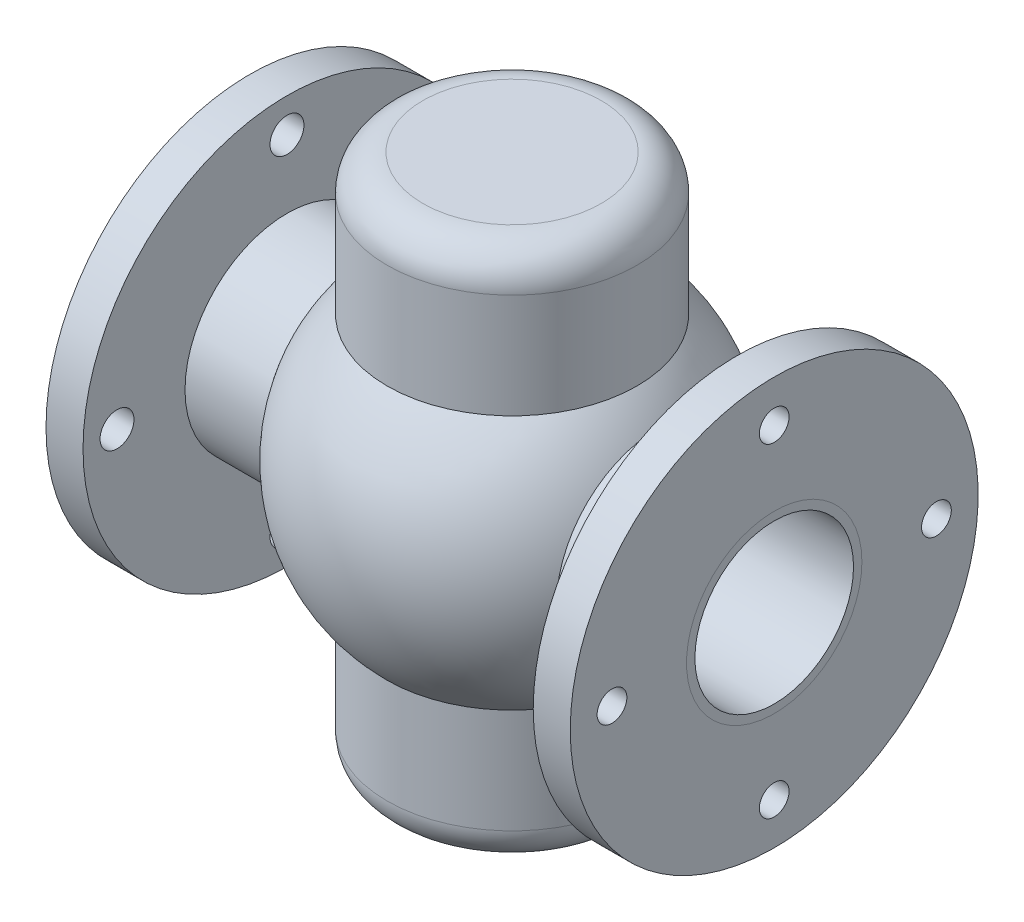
ISO-10303-21;
HEADER;
FILE_DESCRIPTION(('STEP AP214'),'2;1');
FILE_NAME('part.step','',(''),(''),'','','');
FILE_SCHEMA(('AUTOMOTIVE_DESIGN { 1 0 10303 214 1 1 1 1 }'));
ENDSEC;
DATA;
#1=APPLICATION_CONTEXT('core data for automotive mechanical design processes');
#2=APPLICATION_PROTOCOL_DEFINITION('international standard','automotive_design',2000,#1);
#3=PRODUCT_CONTEXT('',#1,'mechanical');
#4=PRODUCT('Part','Part','',(#3));
#5=PRODUCT_RELATED_PRODUCT_CATEGORY('part','',(#4));
#6=PRODUCT_DEFINITION_FORMATION('','',#4);
#7=PRODUCT_DEFINITION_CONTEXT('part definition',#1,'design');
#8=PRODUCT_DEFINITION('design','',#6,#7);
#9=PRODUCT_DEFINITION_SHAPE('','',#8);
#10=(LENGTH_UNIT() NAMED_UNIT(*) SI_UNIT(.MILLI.,.METRE.));
#11=(NAMED_UNIT(*) PLANE_ANGLE_UNIT() SI_UNIT($,.RADIAN.));
#12=(NAMED_UNIT(*) SI_UNIT($,.STERADIAN.) SOLID_ANGLE_UNIT());
#13=UNCERTAINTY_MEASURE_WITH_UNIT(LENGTH_MEASURE(1.E-05),#10,'distance_accuracy_value','');
#14=(GEOMETRIC_REPRESENTATION_CONTEXT(3) GLOBAL_UNCERTAINTY_ASSIGNED_CONTEXT((#13)) GLOBAL_UNIT_ASSIGNED_CONTEXT((#10,
#11,#12)) REPRESENTATION_CONTEXT('',''));
#15=CARTESIAN_POINT('',(0.,0.,0.));
#16=DIRECTION('',(0.,0.,1.));
#17=DIRECTION('',(1.,0.,0.));
#18=AXIS2_PLACEMENT_3D('',#15,#16,#17);
#19=CARTESIAN_POINT('',(146.9,114.3,0.));
#20=DIRECTION('',(1.,0.,0.));
#21=DIRECTION('',(0.,0.,-1.));
#22=AXIS2_PLACEMENT_3D('',#19,#20,#21);
#23=PLANE('',#22);
#24=CARTESIAN_POINT('',(146.9,90.8527596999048,0.));
#25=DIRECTION('',(-1.,0.,0.));
#26=DIRECTION('',(0.,0.,1.));
#27=AXIS2_PLACEMENT_3D('',#24,#25,#26);
#28=CIRCLE('',#27,8.3337399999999);
#29=CARTESIAN_POINT('',(146.9,90.8527596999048,8.3337399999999));
#30=VERTEX_POINT('',#29);
#31=EDGE_CURVE('E146',#30,#30,#28,.T.);
#32=ORIENTED_EDGE('',*,*,#31,.T.);
#33=EDGE_LOOP('',(#32));
#34=FACE_BOUND('',#33,.T.);
#35=CARTESIAN_POINT('',(146.9,0.,90.9113801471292));
#36=DIRECTION('',(-1.,0.,0.));
#37=DIRECTION('',(0.,0.,1.));
#38=AXIS2_PLACEMENT_3D('',#35,#36,#37);
#39=CIRCLE('',#38,8.3337399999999);
#40=CARTESIAN_POINT('',(146.9,0.,99.2451201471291));
#41=VERTEX_POINT('',#40);
#42=EDGE_CURVE('E140',#41,#41,#39,.T.);
#43=ORIENTED_EDGE('',*,*,#42,.T.);
#44=EDGE_LOOP('',(#43));
#45=FACE_BOUND('',#44,.T.);
#46=CARTESIAN_POINT('',(146.9,-90.9113801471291,0.));
#47=DIRECTION('',(-1.,0.,0.));
#48=DIRECTION('',(0.,0.,1.));
#49=AXIS2_PLACEMENT_3D('',#46,#47,#48);
#50=CIRCLE('',#49,8.3337399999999);
#51=CARTESIAN_POINT('',(146.9,-90.9113801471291,8.3337399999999));
#52=VERTEX_POINT('',#51);
#53=EDGE_CURVE('E134',#52,#52,#50,.T.);
#54=ORIENTED_EDGE('',*,*,#53,.T.);
#55=EDGE_LOOP('',(#54));
#56=FACE_BOUND('',#55,.T.);
#57=CARTESIAN_POINT('',(146.9,0.,-90.9113801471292));
#58=DIRECTION('',(-1.,0.,0.));
#59=DIRECTION('',(0.,0.,1.));
#60=AXIS2_PLACEMENT_3D('',#57,#58,#59);
#61=CIRCLE('',#60,8.3337399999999);
#62=CARTESIAN_POINT('',(146.9,0.,-82.5776401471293));
#63=VERTEX_POINT('',#62);
#64=EDGE_CURVE('E128',#63,#63,#61,.T.);
#65=ORIENTED_EDGE('',*,*,#64,.T.);
#66=EDGE_LOOP('',(#65));
#67=FACE_BOUND('',#66,.T.);
#68=CARTESIAN_POINT('',(146.9,0.,0.));
#69=DIRECTION('',(-1.,0.,0.));
#70=DIRECTION('',(0.,0.,1.));
#71=AXIS2_PLACEMENT_3D('',#68,#69,#70);
#72=CIRCLE('',#71,114.3);
#73=CARTESIAN_POINT('',(146.9,0.,114.3));
#74=VERTEX_POINT('',#73);
#75=EDGE_CURVE('E77',#74,#74,#72,.T.);
#76=ORIENTED_EDGE('',*,*,#75,.F.);
#77=EDGE_LOOP('',(#76));
#78=FACE_BOUND('',#77,.T.);
#79=CARTESIAN_POINT('',(146.9,0.,0.));
#80=DIRECTION('',(1.,0.,0.));
#81=DIRECTION('',(0.,0.,-1.));
#82=AXIS2_PLACEMENT_3D('',#79,#80,#81);
#83=CIRCLE('',#82,49.1499994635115);
#84=CARTESIAN_POINT('',(146.9,0.,-49.1499994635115));
#85=VERTEX_POINT('',#84);
#86=EDGE_CURVE('E10',#85,#85,#83,.F.);
#87=ORIENTED_EDGE('',*,*,#86,.T.);
#88=EDGE_LOOP('',(#87));
#89=FACE_BOUND('',#88,.T.);
#90=ADVANCED_FACE('F36',(#34,#45,#56,#67,#78,#89),#23,.T.);
#91=CARTESIAN_POINT('',(150.,0.,0.));
#92=DIRECTION('',(-1.,0.,0.));
#93=DIRECTION('',(0.,0.,1.));
#94=AXIS2_PLACEMENT_3D('',#91,#92,#93);
#95=CYLINDRICAL_SURFACE('',#94,44.45);
#96=CARTESIAN_POINT('',(-150.,0.,0.));
#97=DIRECTION('',(-1.,0.,0.));
#98=DIRECTION('',(0.,0.,1.));
#99=AXIS2_PLACEMENT_3D('',#96,#97,#98);
#100=CIRCLE('',#99,44.45);
#101=CARTESIAN_POINT('',(-150.,0.,44.45));
#102=VERTEX_POINT('',#101);
#103=EDGE_CURVE('E67',#102,#102,#100,.T.);
#104=ORIENTED_EDGE('',*,*,#103,.T.);
#105=EDGE_LOOP('',(#104));
#106=FACE_BOUND('',#105,.T.);
#107=CARTESIAN_POINT('',(146.9,0.,0.));
#108=DIRECTION('',(1.,0.,0.));
#109=DIRECTION('',(0.,0.,-1.));
#110=AXIS2_PLACEMENT_3D('',#107,#108,#109);
#111=CIRCLE('',#110,44.45);
#112=CARTESIAN_POINT('',(146.9,0.,-44.45));
#113=VERTEX_POINT('',#112);
#114=EDGE_CURVE('E123',#113,#113,#111,.F.);
#115=ORIENTED_EDGE('',*,*,#114,.F.);
#116=EDGE_LOOP('',(#115));
#117=FACE_BOUND('',#116,.T.);
#118=ADVANCED_FACE('F175',(#106,#117),#95,.F.);
#119=CARTESIAN_POINT('',(150.,0.,0.));
#120=DIRECTION('',(-1.,0.,0.));
#121=DIRECTION('',(0.,0.,1.));
#122=AXIS2_PLACEMENT_3D('',#119,#120,#121);
#123=CYLINDRICAL_SURFACE('',#122,57.15);
#124=CARTESIAN_POINT('',(126.15,0.,0.));
#125=DIRECTION('',(-1.,0.,0.));
#126=DIRECTION('',(0.,0.,1.));
#127=AXIS2_PLACEMENT_3D('',#124,#125,#126);
#128=CIRCLE('',#127,57.15);
#129=CARTESIAN_POINT('',(126.15,0.,57.15));
#130=VERTEX_POINT('',#129);
#131=EDGE_CURVE('E83',#130,#130,#128,.T.);
#132=ORIENTED_EDGE('',*,*,#131,.T.);
#133=EDGE_LOOP('',(#132));
#134=FACE_BOUND('',#133,.T.);
#135=CARTESIAN_POINT('',(82.0602065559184,0.,0.));
#136=DIRECTION('',(-1.,0.,0.));
#137=DIRECTION('',(0.,0.,1.));
#138=AXIS2_PLACEMENT_3D('',#135,#136,#137);
#139=CIRCLE('',#138,57.15);
#140=CARTESIAN_POINT('',(82.0602065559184,0.,57.15));
#141=VERTEX_POINT('',#140);
#142=EDGE_CURVE('E62',#141,#141,#139,.T.);
#143=ORIENTED_EDGE('',*,*,#142,.F.);
#144=EDGE_LOOP('',(#143));
#145=FACE_BOUND('',#144,.T.);
#146=ADVANCED_FACE('F171',(#134,#145),#123,.T.);
#147=CARTESIAN_POINT('',(0.,0.,0.));
#148=DIRECTION('',(0.,-1.,0.));
#149=DIRECTION('',(1.,0.,0.));
#150=AXIS2_PLACEMENT_3D('',#147,#148,#149);
#151=SPHERICAL_SURFACE('',#150,100.);
#152=CARTESIAN_POINT('',(0.,-71.4142842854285,0.));
#153=DIRECTION('',(0.,1.,0.));
#154=DIRECTION('',(0.,0.,1.));
#155=AXIS2_PLACEMENT_3D('',#152,#153,#154);
#156=CIRCLE('',#155,70.);
#157=CARTESIAN_POINT('',(0.,-71.4142842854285,70.));
#158=VERTEX_POINT('',#157);
#159=EDGE_CURVE('E70',#158,#158,#156,.T.);
#160=ORIENTED_EDGE('',*,*,#159,.T.);
#161=EDGE_LOOP('',(#160));
#162=FACE_BOUND('',#161,.T.);
#163=CARTESIAN_POINT('',(-82.0602065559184,0.,0.));
#164=DIRECTION('',(1.,0.,0.));
#165=DIRECTION('',(0.,0.,-1.));
#166=AXIS2_PLACEMENT_3D('',#163,#164,#165);
#167=CIRCLE('',#166,57.15);
#168=CARTESIAN_POINT('',(-82.0602065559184,0.,-57.15));
#169=VERTEX_POINT('',#168);
#170=EDGE_CURVE('E63',#169,#169,#167,.T.);
#171=ORIENTED_EDGE('',*,*,#170,.T.);
#172=EDGE_LOOP('',(#171));
#173=FACE_BOUND('',#172,.T.);
#174=CARTESIAN_POINT('',(0.,71.4142842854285,0.));
#175=DIRECTION('',(0.,-1.,0.));
#176=DIRECTION('',(0.,0.,-1.));
#177=AXIS2_PLACEMENT_3D('',#174,#175,#176);
#178=CIRCLE('',#177,70.);
#179=CARTESIAN_POINT('',(0.,71.4142842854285,-70.));
#180=VERTEX_POINT('',#179);
#181=EDGE_CURVE('E66',#180,#180,#178,.T.);
#182=ORIENTED_EDGE('',*,*,#181,.T.);
#183=EDGE_LOOP('',(#182));
#184=FACE_BOUND('',#183,.T.);
#185=ORIENTED_EDGE('',*,*,#142,.T.);
#186=EDGE_LOOP('',(#185));
#187=FACE_BOUND('',#186,.T.);
#188=ADVANCED_FACE('F174',(#162,#173,#184,#187),#151,.T.);
#189=CARTESIAN_POINT('',(-150.,0.,0.));
#190=DIRECTION('',(1.,0.,0.));
#191=DIRECTION('',(0.,0.,-1.));
#192=AXIS2_PLACEMENT_3D('',#189,#190,#191);
#193=PLANE('',#192);
#194=ORIENTED_EDGE('',*,*,#103,.F.);
#195=EDGE_LOOP('',(#194));
#196=FACE_BOUND('',#195,.T.);
#197=CARTESIAN_POINT('',(-150.,0.,0.));
#198=DIRECTION('',(-1.,0.,0.));
#199=DIRECTION('',(0.,0.,1.));
#200=AXIS2_PLACEMENT_3D('',#197,#198,#199);
#201=CIRCLE('',#200,67.5);
#202=CARTESIAN_POINT('',(-150.,0.,67.5));
#203=VERTEX_POINT('',#202);
#204=EDGE_CURVE('E86',#203,#203,#201,.T.);
#205=ORIENTED_EDGE('',*,*,#204,.T.);
#206=EDGE_LOOP('',(#205));
#207=FACE_BOUND('',#206,.T.);
#208=ADVANCED_FACE('F181',(#196,#207),#193,.F.);
#209=CARTESIAN_POINT('',(-126.15,0.,0.));
#210=DIRECTION('',(-1.,0.,0.));
#211=DIRECTION('',(0.,0.,1.));
#212=AXIS2_PLACEMENT_3D('',#209,#210,#211);
#213=CIRCLE('',#212,57.15);
#214=CARTESIAN_POINT('',(-126.15,0.,57.15));
#215=VERTEX_POINT('',#214);
#216=EDGE_CURVE('E98',#215,#215,#213,.T.);
#217=ORIENTED_EDGE('',*,*,#216,.F.);
#218=EDGE_LOOP('',(#217));
#219=FACE_BOUND('',#218,.T.);
#220=ORIENTED_EDGE('',*,*,#170,.F.);
#221=EDGE_LOOP('',(#220));
#222=FACE_BOUND('',#221,.T.);
#223=ADVANCED_FACE('F177',(#219,#222),#123,.T.);
#224=CARTESIAN_POINT('',(0.,150.,0.));
#225=DIRECTION('',(0.,1.,0.));
#226=DIRECTION('',(0.,0.,1.));
#227=AXIS2_PLACEMENT_3D('',#224,#225,#226);
#228=PLANE('',#227);
#229=CARTESIAN_POINT('',(0.,150.,0.));
#230=DIRECTION('',(0.,1.,0.));
#231=DIRECTION('',(0.,0.,1.));
#232=AXIS2_PLACEMENT_3D('',#229,#230,#231);
#233=CIRCLE('',#232,50.);
#234=CARTESIAN_POINT('',(0.,150.,50.));
#235=VERTEX_POINT('',#234);
#236=EDGE_CURVE('E59',#235,#235,#233,.T.);
#237=ORIENTED_EDGE('',*,*,#236,.T.);
#238=EDGE_LOOP('',(#237));
#239=FACE_BOUND('',#238,.T.);
#240=ADVANCED_FACE('F233',(#239),#228,.T.);
#241=CARTESIAN_POINT('',(0.,150.,0.));
#242=DIRECTION('',(0.,-1.,0.));
#243=DIRECTION('',(0.,0.,-1.));
#244=AXIS2_PLACEMENT_3D('',#241,#242,#243);
#245=CYLINDRICAL_SURFACE('',#244,70.);
#246=CARTESIAN_POINT('',(0.,130.,0.));
#247=DIRECTION('',(0.,1.,0.));
#248=DIRECTION('',(0.,0.,1.));
#249=AXIS2_PLACEMENT_3D('',#246,#247,#248);
#250=CIRCLE('',#249,70.);
#251=CARTESIAN_POINT('',(0.,130.,70.));
#252=VERTEX_POINT('',#251);
#253=EDGE_CURVE('E54',#252,#252,#250,.F.);
#254=ORIENTED_EDGE('',*,*,#253,.T.);
#255=EDGE_LOOP('',(#254));
#256=FACE_BOUND('',#255,.T.);
#257=ORIENTED_EDGE('',*,*,#181,.F.);
#258=EDGE_LOOP('',(#257));
#259=FACE_BOUND('',#258,.T.);
#260=ADVANCED_FACE('F226',(#256,#259),#245,.T.);
#261=CARTESIAN_POINT('',(0.,-150.,0.));
#262=DIRECTION('',(0.,1.,0.));
#263=DIRECTION('',(0.,0.,1.));
#264=AXIS2_PLACEMENT_3D('',#261,#262,#263);
#265=PLANE('',#264);
#266=CARTESIAN_POINT('',(0.,-150.,0.));
#267=DIRECTION('',(0.,1.,0.));
#268=DIRECTION('',(0.,0.,1.));
#269=AXIS2_PLACEMENT_3D('',#266,#267,#268);
#270=CIRCLE('',#269,50.);
#271=CARTESIAN_POINT('',(0.,-150.,50.));
#272=VERTEX_POINT('',#271);
#273=EDGE_CURVE('E44',#272,#272,#270,.F.);
#274=ORIENTED_EDGE('',*,*,#273,.T.);
#275=EDGE_LOOP('',(#274));
#276=FACE_BOUND('',#275,.T.);
#277=ADVANCED_FACE('F224',(#276),#265,.F.);
#278=CARTESIAN_POINT('',(0.,-130.,0.));
#279=DIRECTION('',(0.,1.,0.));
#280=DIRECTION('',(0.,0.,1.));
#281=AXIS2_PLACEMENT_3D('',#278,#279,#280);
#282=CIRCLE('',#281,70.);
#283=CARTESIAN_POINT('',(0.,-130.,70.));
#284=VERTEX_POINT('',#283);
#285=EDGE_CURVE('E50',#284,#284,#282,.T.);
#286=ORIENTED_EDGE('',*,*,#285,.T.);
#287=EDGE_LOOP('',(#286));
#288=FACE_BOUND('',#287,.T.);
#289=ORIENTED_EDGE('',*,*,#159,.F.);
#290=EDGE_LOOP('',(#289));
#291=FACE_BOUND('',#290,.T.);
#292=ADVANCED_FACE('F217',(#288,#291),#245,.T.);
#293=CARTESIAN_POINT('',(0.,130.,0.));
#294=DIRECTION('',(0.,1.,0.));
#295=DIRECTION('',(0.,0.,1.));
#296=AXIS2_PLACEMENT_3D('',#293,#294,#295);
#297=TOROIDAL_SURFACE('',#296,50.,20.);
#298=ORIENTED_EDGE('',*,*,#253,.F.);
#299=EDGE_LOOP('',(#298));
#300=FACE_BOUND('',#299,.T.);
#301=ORIENTED_EDGE('',*,*,#236,.F.);
#302=EDGE_LOOP('',(#301));
#303=FACE_BOUND('',#302,.T.);
#304=ADVANCED_FACE('F209',(#300,#303),#297,.T.);
#305=CARTESIAN_POINT('',(0.,-130.,0.));
#306=DIRECTION('',(0.,1.,0.));
#307=DIRECTION('',(0.,0.,1.));
#308=AXIS2_PLACEMENT_3D('',#305,#306,#307);
#309=TOROIDAL_SURFACE('',#308,50.,20.);
#310=ORIENTED_EDGE('',*,*,#273,.F.);
#311=EDGE_LOOP('',(#310));
#312=FACE_BOUND('',#311,.T.);
#313=ORIENTED_EDGE('',*,*,#285,.F.);
#314=EDGE_LOOP('',(#313));
#315=FACE_BOUND('',#314,.T.);
#316=ADVANCED_FACE('F38',(#312,#315),#309,.T.);
#317=ORIENTED_EDGE('',*,*,#86,.F.);
#318=EDGE_LOOP('',(#317));
#319=FACE_BOUND('',#318,.T.);
#320=ORIENTED_EDGE('',*,*,#114,.T.);
#321=EDGE_LOOP('',(#320));
#322=FACE_BOUND('',#321,.T.);
#323=ADVANCED_FACE('F195',(#319,#322),#23,.T.);
#324=CARTESIAN_POINT('',(0.,0.,0.));
#325=DIRECTION('',(-1.,0.,0.));
#326=DIRECTION('',(0.,0.,1.));
#327=AXIS2_PLACEMENT_3D('',#324,#325,#326);
#328=CYLINDRICAL_SURFACE('',#327,114.3);
#329=ORIENTED_EDGE('',*,*,#75,.T.);
#330=EDGE_LOOP('',(#329));
#331=FACE_BOUND('',#330,.T.);
#332=CARTESIAN_POINT('',(126.15,0.,0.));
#333=DIRECTION('',(-1.,0.,0.));
#334=DIRECTION('',(0.,0.,1.));
#335=AXIS2_PLACEMENT_3D('',#332,#333,#334);
#336=CIRCLE('',#335,114.3);
#337=CARTESIAN_POINT('',(126.15,0.,114.3));
#338=VERTEX_POINT('',#337);
#339=EDGE_CURVE('E80',#338,#338,#336,.T.);
#340=ORIENTED_EDGE('',*,*,#339,.F.);
#341=EDGE_LOOP('',(#340));
#342=FACE_BOUND('',#341,.T.);
#343=ADVANCED_FACE('F159',(#331,#342),#328,.T.);
#344=CARTESIAN_POINT('',(126.15,57.15,0.));
#345=DIRECTION('',(-1.,0.,0.));
#346=DIRECTION('',(0.,0.,1.));
#347=AXIS2_PLACEMENT_3D('',#344,#345,#346);
#348=PLANE('',#347);
#349=CARTESIAN_POINT('',(126.15,90.8527596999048,0.));
#350=DIRECTION('',(-1.,0.,0.));
#351=DIRECTION('',(0.,0.,1.));
#352=AXIS2_PLACEMENT_3D('',#349,#350,#351);
#353=CIRCLE('',#352,8.3337399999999);
#354=CARTESIAN_POINT('',(126.15,90.8527596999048,8.3337399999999));
#355=VERTEX_POINT('',#354);
#356=EDGE_CURVE('E149',#355,#355,#353,.T.);
#357=ORIENTED_EDGE('',*,*,#356,.F.);
#358=EDGE_LOOP('',(#357));
#359=FACE_BOUND('',#358,.T.);
#360=CARTESIAN_POINT('',(126.15,0.,90.9113801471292));
#361=DIRECTION('',(-1.,0.,0.));
#362=DIRECTION('',(0.,0.,1.));
#363=AXIS2_PLACEMENT_3D('',#360,#361,#362);
#364=CIRCLE('',#363,8.3337399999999);
#365=CARTESIAN_POINT('',(126.15,0.,99.2451201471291));
#366=VERTEX_POINT('',#365);
#367=EDGE_CURVE('E143',#366,#366,#364,.T.);
#368=ORIENTED_EDGE('',*,*,#367,.F.);
#369=EDGE_LOOP('',(#368));
#370=FACE_BOUND('',#369,.T.);
#371=CARTESIAN_POINT('',(126.15,-90.9113801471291,0.));
#372=DIRECTION('',(-1.,0.,0.));
#373=DIRECTION('',(0.,0.,1.));
#374=AXIS2_PLACEMENT_3D('',#371,#372,#373);
#375=CIRCLE('',#374,8.3337399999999);
#376=CARTESIAN_POINT('',(126.15,-90.9113801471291,8.3337399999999));
#377=VERTEX_POINT('',#376);
#378=EDGE_CURVE('E137',#377,#377,#375,.T.);
#379=ORIENTED_EDGE('',*,*,#378,.F.);
#380=EDGE_LOOP('',(#379));
#381=FACE_BOUND('',#380,.T.);
#382=CARTESIAN_POINT('',(126.15,0.,-90.9113801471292));
#383=DIRECTION('',(-1.,0.,0.));
#384=DIRECTION('',(0.,0.,1.));
#385=AXIS2_PLACEMENT_3D('',#382,#383,#384);
#386=CIRCLE('',#385,8.3337399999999);
#387=CARTESIAN_POINT('',(126.15,0.,-82.5776401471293));
#388=VERTEX_POINT('',#387);
#389=EDGE_CURVE('E131',#388,#388,#386,.T.);
#390=ORIENTED_EDGE('',*,*,#389,.F.);
#391=EDGE_LOOP('',(#390));
#392=FACE_BOUND('',#391,.T.);
#393=ORIENTED_EDGE('',*,*,#339,.T.);
#394=EDGE_LOOP('',(#393));
#395=FACE_BOUND('',#394,.T.);
#396=ORIENTED_EDGE('',*,*,#131,.F.);
#397=EDGE_LOOP('',(#396));
#398=FACE_BOUND('',#397,.T.);
#399=ADVANCED_FACE('F155',(#359,#370,#381,#392,#395,#398),#348,.T.);
#400=CARTESIAN_POINT('',(0.,0.,0.));
#401=DIRECTION('',(1.,0.,0.));
#402=DIRECTION('',(0.,0.,1.));
#403=AXIS2_PLACEMENT_3D('',#400,#401,#402);
#404=CYLINDRICAL_SURFACE('',#403,67.5);
#405=ORIENTED_EDGE('',*,*,#204,.F.);
#406=EDGE_LOOP('',(#405));
#407=FACE_BOUND('',#406,.T.);
#408=CARTESIAN_POINT('',(-146.9,0.,0.));
#409=DIRECTION('',(-1.,0.,0.));
#410=DIRECTION('',(0.,0.,1.));
#411=AXIS2_PLACEMENT_3D('',#408,#409,#410);
#412=CIRCLE('',#411,67.5);
#413=CARTESIAN_POINT('',(-146.9,0.,67.5));
#414=VERTEX_POINT('',#413);
#415=EDGE_CURVE('E89',#414,#414,#412,.T.);
#416=ORIENTED_EDGE('',*,*,#415,.T.);
#417=EDGE_LOOP('',(#416));
#418=FACE_BOUND('',#417,.T.);
#419=ADVANCED_FACE('F158',(#407,#418),#404,.T.);
#420=CARTESIAN_POINT('',(-146.9,114.3,0.));
#421=DIRECTION('',(-1.,0.,0.));
#422=DIRECTION('',(0.,0.,-1.));
#423=AXIS2_PLACEMENT_3D('',#420,#421,#422);
#424=PLANE('',#423);
#425=CARTESIAN_POINT('',(-146.9,9.97691370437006E-13,-95.25));
#426=DIRECTION('',(-1.,0.,0.));
#427=DIRECTION('',(0.,1.,0.));
#428=AXIS2_PLACEMENT_3D('',#425,#426,#427);
#429=CIRCLE('',#428,9.49999999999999);
#430=CARTESIAN_POINT('',(-146.9,9.50000000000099,-95.2499999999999));
#431=VERTEX_POINT('',#430);
#432=EDGE_CURVE('E120',#431,#431,#429,.T.);
#433=ORIENTED_EDGE('',*,*,#432,.F.);
#434=EDGE_LOOP('',(#433));
#435=FACE_BOUND('',#434,.T.);
#436=CARTESIAN_POINT('',(-146.9,-95.25,-6.65127580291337E-13));
#437=DIRECTION('',(-1.,0.,0.));
#438=DIRECTION('',(0.,0.,-1.));
#439=AXIS2_PLACEMENT_3D('',#436,#437,#438);
#440=CIRCLE('',#439,9.49999999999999);
#441=CARTESIAN_POINT('',(-146.9,-95.2499999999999,-9.50000000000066));
#442=VERTEX_POINT('',#441);
#443=EDGE_CURVE('E114',#442,#442,#440,.T.);
#444=ORIENTED_EDGE('',*,*,#443,.F.);
#445=EDGE_LOOP('',(#444));
#446=FACE_BOUND('',#445,.T.);
#447=CARTESIAN_POINT('',(-146.9,-3.32563790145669E-13,95.25));
#448=DIRECTION('',(-1.,0.,0.));
#449=DIRECTION('',(0.,-1.,0.));
#450=AXIS2_PLACEMENT_3D('',#447,#448,#449);
#451=CIRCLE('',#450,9.49999999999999);
#452=CARTESIAN_POINT('',(-146.9,-9.50000000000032,95.25));
#453=VERTEX_POINT('',#452);
#454=EDGE_CURVE('E108',#453,#453,#451,.T.);
#455=ORIENTED_EDGE('',*,*,#454,.F.);
#456=EDGE_LOOP('',(#455));
#457=FACE_BOUND('',#456,.T.);
#458=CARTESIAN_POINT('',(-146.9,95.25,0.));
#459=DIRECTION('',(-1.,0.,0.));
#460=DIRECTION('',(0.,0.,1.));
#461=AXIS2_PLACEMENT_3D('',#458,#459,#460);
#462=CIRCLE('',#461,9.49999999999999);
#463=CARTESIAN_POINT('',(-146.9,95.25,9.49999999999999));
#464=VERTEX_POINT('',#463);
#465=EDGE_CURVE('E102',#464,#464,#462,.T.);
#466=ORIENTED_EDGE('',*,*,#465,.F.);
#467=EDGE_LOOP('',(#466));
#468=FACE_BOUND('',#467,.T.);
#469=ORIENTED_EDGE('',*,*,#415,.F.);
#470=EDGE_LOOP('',(#469));
#471=FACE_BOUND('',#470,.T.);
#472=CARTESIAN_POINT('',(-146.9,0.,0.));
#473=DIRECTION('',(-1.,0.,0.));
#474=DIRECTION('',(0.,0.,1.));
#475=AXIS2_PLACEMENT_3D('',#472,#473,#474);
#476=CIRCLE('',#475,114.3);
#477=CARTESIAN_POINT('',(-146.9,0.,114.3));
#478=VERTEX_POINT('',#477);
#479=EDGE_CURVE('E92',#478,#478,#476,.T.);
#480=ORIENTED_EDGE('',*,*,#479,.T.);
#481=EDGE_LOOP('',(#480));
#482=FACE_BOUND('',#481,.T.);
#483=ADVANCED_FACE('F268',(#435,#446,#457,#468,#471,#482),#424,.T.);
#484=CARTESIAN_POINT('',(0.,0.,0.));
#485=DIRECTION('',(1.,0.,0.));
#486=DIRECTION('',(0.,0.,1.));
#487=AXIS2_PLACEMENT_3D('',#484,#485,#486);
#488=CYLINDRICAL_SURFACE('',#487,114.3);
#489=ORIENTED_EDGE('',*,*,#479,.F.);
#490=EDGE_LOOP('',(#489));
#491=FACE_BOUND('',#490,.T.);
#492=CARTESIAN_POINT('',(-126.15,0.,0.));
#493=DIRECTION('',(-1.,0.,0.));
#494=DIRECTION('',(0.,0.,1.));
#495=AXIS2_PLACEMENT_3D('',#492,#493,#494);
#496=CIRCLE('',#495,114.3);
#497=CARTESIAN_POINT('',(-126.15,0.,114.3));
#498=VERTEX_POINT('',#497);
#499=EDGE_CURVE('E95',#498,#498,#496,.T.);
#500=ORIENTED_EDGE('',*,*,#499,.T.);
#501=EDGE_LOOP('',(#500));
#502=FACE_BOUND('',#501,.T.);
#503=ADVANCED_FACE('F258',(#491,#502),#488,.T.);
#504=CARTESIAN_POINT('',(-126.15,57.15,0.));
#505=DIRECTION('',(1.,0.,0.));
#506=DIRECTION('',(0.,0.,1.));
#507=AXIS2_PLACEMENT_3D('',#504,#505,#506);
#508=PLANE('',#507);
#509=CARTESIAN_POINT('',(-126.15,9.97691370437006E-13,-95.25));
#510=DIRECTION('',(1.,0.,0.));
#511=DIRECTION('',(0.,0.,-1.));
#512=AXIS2_PLACEMENT_3D('',#509,#510,#511);
#513=CIRCLE('',#512,9.49999999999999);
#514=CARTESIAN_POINT('',(-126.15,9.97691370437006E-13,-104.75));
#515=VERTEX_POINT('',#514);
#516=EDGE_CURVE('E117',#515,#515,#513,.F.);
#517=ORIENTED_EDGE('',*,*,#516,.T.);
#518=EDGE_LOOP('',(#517));
#519=FACE_BOUND('',#518,.T.);
#520=CARTESIAN_POINT('',(-126.15,-95.25,-6.65127580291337E-13));
#521=DIRECTION('',(1.,0.,0.));
#522=DIRECTION('',(0.,0.,-1.));
#523=AXIS2_PLACEMENT_3D('',#520,#521,#522);
#524=CIRCLE('',#523,9.49999999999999);
#525=CARTESIAN_POINT('',(-126.15,-95.25,-9.50000000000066));
#526=VERTEX_POINT('',#525);
#527=EDGE_CURVE('E111',#526,#526,#524,.F.);
#528=ORIENTED_EDGE('',*,*,#527,.T.);
#529=EDGE_LOOP('',(#528));
#530=FACE_BOUND('',#529,.T.);
#531=CARTESIAN_POINT('',(-126.15,-3.32563790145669E-13,95.25));
#532=DIRECTION('',(1.,0.,0.));
#533=DIRECTION('',(0.,0.,-1.));
#534=AXIS2_PLACEMENT_3D('',#531,#532,#533);
#535=CIRCLE('',#534,9.49999999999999);
#536=CARTESIAN_POINT('',(-126.15,-3.32563790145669E-13,85.75));
#537=VERTEX_POINT('',#536);
#538=EDGE_CURVE('E105',#537,#537,#535,.F.);
#539=ORIENTED_EDGE('',*,*,#538,.T.);
#540=EDGE_LOOP('',(#539));
#541=FACE_BOUND('',#540,.T.);
#542=CARTESIAN_POINT('',(-126.15,95.25,0.));
#543=DIRECTION('',(1.,0.,0.));
#544=DIRECTION('',(0.,0.,-1.));
#545=AXIS2_PLACEMENT_3D('',#542,#543,#544);
#546=CIRCLE('',#545,9.49999999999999);
#547=CARTESIAN_POINT('',(-126.15,95.25,-9.49999999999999));
#548=VERTEX_POINT('',#547);
#549=EDGE_CURVE('E101',#548,#548,#546,.F.);
#550=ORIENTED_EDGE('',*,*,#549,.T.);
#551=EDGE_LOOP('',(#550));
#552=FACE_BOUND('',#551,.T.);
#553=ORIENTED_EDGE('',*,*,#499,.F.);
#554=EDGE_LOOP('',(#553));
#555=FACE_BOUND('',#554,.T.);
#556=ORIENTED_EDGE('',*,*,#216,.T.);
#557=EDGE_LOOP('',(#556));
#558=FACE_BOUND('',#557,.T.);
#559=ADVANCED_FACE('F255',(#519,#530,#541,#552,#555,#558),#508,.T.);
#560=CARTESIAN_POINT('',(150.001,95.25,0.));
#561=DIRECTION('',(-1.,0.,0.));
#562=DIRECTION('',(0.,0.,1.));
#563=AXIS2_PLACEMENT_3D('',#560,#561,#562);
#564=CYLINDRICAL_SURFACE('',#563,9.49999999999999);
#565=ORIENTED_EDGE('',*,*,#549,.F.);
#566=EDGE_LOOP('',(#565));
#567=FACE_BOUND('',#566,.T.);
#568=ORIENTED_EDGE('',*,*,#465,.T.);
#569=EDGE_LOOP('',(#568));
#570=FACE_BOUND('',#569,.T.);
#571=ADVANCED_FACE('F257',(#567,#570),#564,.F.);
#572=CARTESIAN_POINT('',(150.001,-3.32563790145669E-13,95.25));
#573=DIRECTION('',(-1.,0.,0.));
#574=DIRECTION('',(0.,0.,1.));
#575=AXIS2_PLACEMENT_3D('',#572,#573,#574);
#576=CYLINDRICAL_SURFACE('',#575,9.49999999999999);
#577=ORIENTED_EDGE('',*,*,#538,.F.);
#578=EDGE_LOOP('',(#577));
#579=FACE_BOUND('',#578,.T.);
#580=ORIENTED_EDGE('',*,*,#454,.T.);
#581=EDGE_LOOP('',(#580));
#582=FACE_BOUND('',#581,.T.);
#583=ADVANCED_FACE('F265',(#579,#582),#576,.F.);
#584=CARTESIAN_POINT('',(150.001,-95.25,-6.65127580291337E-13));
#585=DIRECTION('',(-1.,0.,0.));
#586=DIRECTION('',(0.,0.,1.));
#587=AXIS2_PLACEMENT_3D('',#584,#585,#586);
#588=CYLINDRICAL_SURFACE('',#587,9.49999999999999);
#589=ORIENTED_EDGE('',*,*,#527,.F.);
#590=EDGE_LOOP('',(#589));
#591=FACE_BOUND('',#590,.T.);
#592=ORIENTED_EDGE('',*,*,#443,.T.);
#593=EDGE_LOOP('',(#592));
#594=FACE_BOUND('',#593,.T.);
#595=ADVANCED_FACE('F326',(#591,#594),#588,.F.);
#596=CARTESIAN_POINT('',(150.001,9.97691370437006E-13,-95.25));
#597=DIRECTION('',(-1.,0.,0.));
#598=DIRECTION('',(0.,0.,1.));
#599=AXIS2_PLACEMENT_3D('',#596,#597,#598);
#600=CYLINDRICAL_SURFACE('',#599,9.49999999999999);
#601=ORIENTED_EDGE('',*,*,#516,.F.);
#602=EDGE_LOOP('',(#601));
#603=FACE_BOUND('',#602,.T.);
#604=ORIENTED_EDGE('',*,*,#432,.T.);
#605=EDGE_LOOP('',(#604));
#606=FACE_BOUND('',#605,.T.);
#607=ADVANCED_FACE('F318',(#603,#606),#600,.F.);
#608=CARTESIAN_POINT('',(126.15,0.,-90.9113801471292));
#609=DIRECTION('',(-1.,0.,0.));
#610=DIRECTION('',(0.,0.,1.));
#611=AXIS2_PLACEMENT_3D('',#608,#609,#610);
#612=CYLINDRICAL_SURFACE('',#611,8.3337399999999);
#613=ORIENTED_EDGE('',*,*,#64,.F.);
#614=EDGE_LOOP('',(#613));
#615=FACE_BOUND('',#614,.T.);
#616=ORIENTED_EDGE('',*,*,#389,.T.);
#617=EDGE_LOOP('',(#616));
#618=FACE_BOUND('',#617,.T.);
#619=ADVANCED_FACE('F340',(#615,#618),#612,.F.);
#620=CARTESIAN_POINT('',(126.15,-90.9113801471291,0.));
#621=DIRECTION('',(-1.,0.,0.));
#622=DIRECTION('',(0.,0.,1.));
#623=AXIS2_PLACEMENT_3D('',#620,#621,#622);
#624=CYLINDRICAL_SURFACE('',#623,8.3337399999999);
#625=ORIENTED_EDGE('',*,*,#53,.F.);
#626=EDGE_LOOP('',(#625));
#627=FACE_BOUND('',#626,.T.);
#628=ORIENTED_EDGE('',*,*,#378,.T.);
#629=EDGE_LOOP('',(#628));
#630=FACE_BOUND('',#629,.T.);
#631=ADVANCED_FACE('F346',(#627,#630),#624,.F.);
#632=CARTESIAN_POINT('',(126.15,0.,90.9113801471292));
#633=DIRECTION('',(-1.,0.,0.));
#634=DIRECTION('',(0.,0.,1.));
#635=AXIS2_PLACEMENT_3D('',#632,#633,#634);
#636=CYLINDRICAL_SURFACE('',#635,8.3337399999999);
#637=ORIENTED_EDGE('',*,*,#42,.F.);
#638=EDGE_LOOP('',(#637));
#639=FACE_BOUND('',#638,.T.);
#640=ORIENTED_EDGE('',*,*,#367,.T.);
#641=EDGE_LOOP('',(#640));
#642=FACE_BOUND('',#641,.T.);
#643=ADVANCED_FACE('F354',(#639,#642),#636,.F.);
#644=CARTESIAN_POINT('',(126.15,90.8527596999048,0.));
#645=DIRECTION('',(-1.,0.,0.));
#646=DIRECTION('',(0.,0.,1.));
#647=AXIS2_PLACEMENT_3D('',#644,#645,#646);
#648=CYLINDRICAL_SURFACE('',#647,8.3337399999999);
#649=ORIENTED_EDGE('',*,*,#31,.F.);
#650=EDGE_LOOP('',(#649));
#651=FACE_BOUND('',#650,.T.);
#652=ORIENTED_EDGE('',*,*,#356,.T.);
#653=EDGE_LOOP('',(#652));
#654=FACE_BOUND('',#653,.T.);
#655=ADVANCED_FACE('F153',(#651,#654),#648,.F.);
#656=CLOSED_SHELL('',(#90,#118,#146,#188,#208,#223,#240,#260,#277,#292,#304,#316,#323,#343,#399,
#419,#483,#503,#559,#571,#583,#595,#607,#619,#631,#643,#655));
#657=MANIFOLD_SOLID_BREP('B2',#656);
#658=ADVANCED_BREP_SHAPE_REPRESENTATION('',(#18,#657),#14);
#659=SHAPE_DEFINITION_REPRESENTATION(#9,#658);
ENDSEC;
END-ISO-10303-21;
